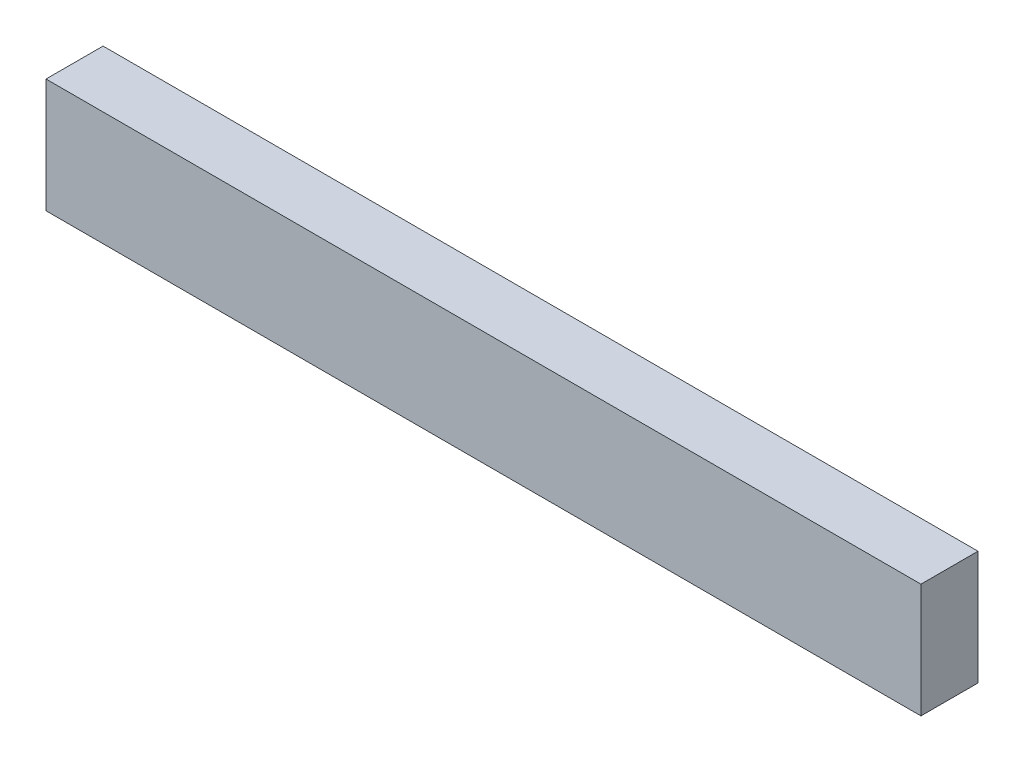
from build123d import *

# Parameters (mm, degrees)
ESQUISSE1_W        = 23
ESQUISSE1_H        = 3
BOSS_EXTRU_1_DEPTH = 1.5


with BuildPart() as part:
    # Esquisse1 → Boss.-Extru.1 (new body)
    with BuildSketch(Plane.XY):
        with Locations((14.386506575, 1.5)):
            Rectangle(ESQUISSE1_W, ESQUISSE1_H)
    extrude(amount=BOSS_EXTRU_1_DEPTH)


solid = part.part
